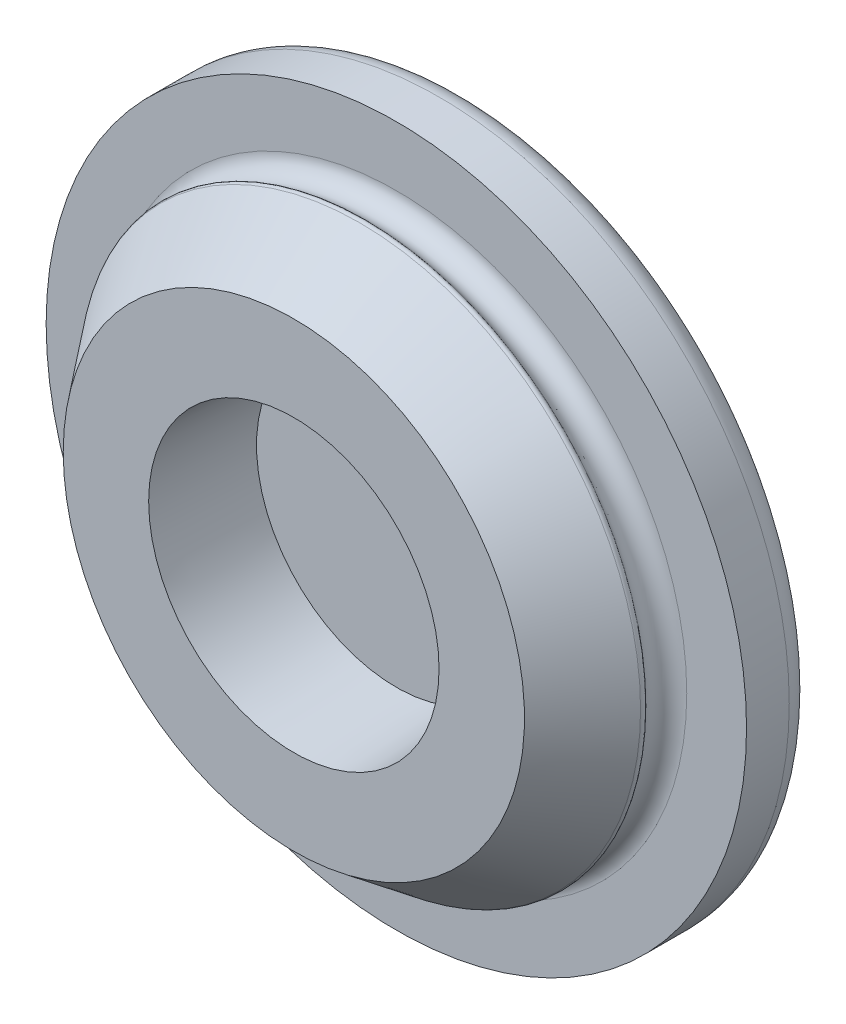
ISO-10303-21;
HEADER;
FILE_DESCRIPTION(('STEP AP214'),'2;1');
FILE_NAME('part.step','',(''),(''),'','','');
FILE_SCHEMA(('AUTOMOTIVE_DESIGN { 1 0 10303 214 1 1 1 1 }'));
ENDSEC;
DATA;
#1=APPLICATION_CONTEXT('core data for automotive mechanical design processes');
#2=APPLICATION_PROTOCOL_DEFINITION('international standard','automotive_design',2000,#1);
#3=PRODUCT_CONTEXT('',#1,'mechanical');
#4=PRODUCT('Part','Part','',(#3));
#5=PRODUCT_RELATED_PRODUCT_CATEGORY('part','',(#4));
#6=PRODUCT_DEFINITION_FORMATION('','',#4);
#7=PRODUCT_DEFINITION_CONTEXT('part definition',#1,'design');
#8=PRODUCT_DEFINITION('design','',#6,#7);
#9=PRODUCT_DEFINITION_SHAPE('','',#8);
#10=(LENGTH_UNIT() NAMED_UNIT(*) SI_UNIT(.MILLI.,.METRE.));
#11=(NAMED_UNIT(*) PLANE_ANGLE_UNIT() SI_UNIT($,.RADIAN.));
#12=(NAMED_UNIT(*) SI_UNIT($,.STERADIAN.) SOLID_ANGLE_UNIT());
#13=UNCERTAINTY_MEASURE_WITH_UNIT(LENGTH_MEASURE(1.E-05),#10,'distance_accuracy_value','');
#14=(GEOMETRIC_REPRESENTATION_CONTEXT(3) GLOBAL_UNCERTAINTY_ASSIGNED_CONTEXT((#13)) GLOBAL_UNIT_ASSIGNED_CONTEXT((#10,
#11,#12)) REPRESENTATION_CONTEXT('',''));
#15=CARTESIAN_POINT('',(0.,0.,0.));
#16=DIRECTION('',(0.,0.,1.));
#17=DIRECTION('',(1.,0.,0.));
#18=AXIS2_PLACEMENT_3D('',#15,#16,#17);
#19=CARTESIAN_POINT('',(4.09277666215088,0.,4.));
#20=DIRECTION('',(0.,0.,1.));
#21=DIRECTION('',(1.,0.,0.));
#22=AXIS2_PLACEMENT_3D('',#19,#20,#21);
#23=PLANE('',#22);
#24=CARTESIAN_POINT('',(0.,0.,3.9999999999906));
#25=DIRECTION('',(0.,0.,1.));
#26=DIRECTION('',(1.,0.,0.));
#27=AXIS2_PLACEMENT_3D('',#24,#25,#26);
#28=CIRCLE('',#27,8.18555332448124);
#29=CARTESIAN_POINT('',(8.18555332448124,0.,3.9999999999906));
#30=VERTEX_POINT('',#29);
#31=EDGE_CURVE('E17',#30,#30,#28,.T.);
#32=ORIENTED_EDGE('',*,*,#31,.T.);
#33=EDGE_LOOP('',(#32));
#34=FACE_BOUND('',#33,.T.);
#35=ADVANCED_FACE('F13',(#34),#23,.T.);
#36=CARTESIAN_POINT('',(0.,0.,10.0000000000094));
#37=DIRECTION('',(0.,0.,1.));
#38=DIRECTION('',(1.,0.,0.));
#39=AXIS2_PLACEMENT_3D('',#36,#37,#38);
#40=CONICAL_SURFACE('',#39,8.49999999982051,0.0523598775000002);
#41=CARTESIAN_POINT('',(0.,0.,10.0000000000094));
#42=DIRECTION('',(0.,0.,1.));
#43=DIRECTION('',(1.,0.,0.));
#44=AXIS2_PLACEMENT_3D('',#41,#42,#43);
#45=CIRCLE('',#44,8.49999999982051);
#46=CARTESIAN_POINT('',(8.49999999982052,0.,10.0000000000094));
#47=VERTEX_POINT('',#46);
#48=EDGE_CURVE('E86',#47,#47,#45,.F.);
#49=ORIENTED_EDGE('',*,*,#48,.F.);
#50=EDGE_LOOP('',(#49));
#51=FACE_BOUND('',#50,.T.);
#52=ORIENTED_EDGE('',*,*,#31,.F.);
#53=EDGE_LOOP('',(#52));
#54=FACE_BOUND('',#53,.T.);
#55=ADVANCED_FACE('F94',(#51,#54),#40,.F.);
#56=CARTESIAN_POINT('',(11.,0.,10.));
#57=DIRECTION('',(0.,0.,1.));
#58=DIRECTION('',(1.,0.,0.));
#59=AXIS2_PLACEMENT_3D('',#56,#57,#58);
#60=PLANE('',#59);
#61=ORIENTED_EDGE('',*,*,#48,.T.);
#62=EDGE_LOOP('',(#61));
#63=FACE_BOUND('',#62,.T.);
#64=CARTESIAN_POINT('',(0.,0.,10.0000000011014));
#65=DIRECTION('',(0.,0.,-1.));
#66=DIRECTION('',(-1.,0.,0.));
#67=AXIS2_PLACEMENT_3D('',#64,#65,#66);
#68=CIRCLE('',#67,13.5000000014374);
#69=CARTESIAN_POINT('',(-13.5000000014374,0.,10.0000000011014));
#70=VERTEX_POINT('',#69);
#71=EDGE_CURVE('E80',#70,#70,#68,.T.);
#72=ORIENTED_EDGE('',*,*,#71,.F.);
#73=EDGE_LOOP('',(#72));
#74=FACE_BOUND('',#73,.T.);
#75=ADVANCED_FACE('F96',(#63,#74),#60,.T.);
#76=CARTESIAN_POINT('',(0.,0.,6.15205431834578));
#77=DIRECTION('',(0.,0.,-1.));
#78=DIRECTION('',(-1.,0.,0.));
#79=AXIS2_PLACEMENT_3D('',#76,#77,#78);
#80=CONICAL_SURFACE('',#79,16.4484426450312,0.653812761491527);
#81=CARTESIAN_POINT('',(0.,0.,6.15205431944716));
#82=DIRECTION('',(0.,0.,1.));
#83=DIRECTION('',(1.,0.,0.));
#84=AXIS2_PLACEMENT_3D('',#81,#82,#83);
#85=CIRCLE('',#84,16.4484426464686);
#86=CARTESIAN_POINT('',(16.4484426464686,0.,6.15205431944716));
#87=VERTEX_POINT('',#86);
#88=EDGE_CURVE('E77',#87,#87,#85,.F.);
#89=ORIENTED_EDGE('',*,*,#88,.F.);
#90=EDGE_LOOP('',(#89));
#91=FACE_BOUND('',#90,.T.);
#92=ORIENTED_EDGE('',*,*,#71,.T.);
#93=EDGE_LOOP('',(#92));
#94=FACE_BOUND('',#93,.T.);
#95=ADVANCED_FACE('F71',(#91,#94),#80,.T.);
#96=CARTESIAN_POINT('',(0.,0.,6.));
#97=DIRECTION('',(0.,0.,1.));
#98=DIRECTION('',(1.,0.,0.));
#99=AXIS2_PLACEMENT_3D('',#96,#97,#98);
#100=TOROIDAL_SURFACE('',#99,16.25,0.25);
#101=CARTESIAN_POINT('',(0.,0.,5.80000000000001));
#102=DIRECTION('',(0.,0.,-1.));
#103=DIRECTION('',(-1.,0.,0.));
#104=AXIS2_PLACEMENT_3D('',#101,#102,#103);
#105=CIRCLE('',#104,16.4);
#106=CARTESIAN_POINT('',(-16.4,0.,5.80000000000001));
#107=VERTEX_POINT('',#106);
#108=EDGE_CURVE('E45',#107,#107,#105,.T.);
#109=ORIENTED_EDGE('',*,*,#108,.F.);
#110=EDGE_LOOP('',(#109));
#111=FACE_BOUND('',#110,.T.);
#112=ORIENTED_EDGE('',*,*,#88,.T.);
#113=EDGE_LOOP('',(#112));
#114=FACE_BOUND('',#113,.T.);
#115=ADVANCED_FACE('F67',(#111,#114),#100,.T.);
#116=CARTESIAN_POINT('',(0.,0.,5.));
#117=DIRECTION('',(0.,0.,1.));
#118=DIRECTION('',(1.,0.,0.));
#119=AXIS2_PLACEMENT_3D('',#116,#117,#118);
#120=TOROIDAL_SURFACE('',#119,17.,1.00000000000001);
#121=CARTESIAN_POINT('',(0.,0.,4.));
#122=DIRECTION('',(0.,0.,1.));
#123=DIRECTION('',(1.,0.,0.));
#124=AXIS2_PLACEMENT_3D('',#121,#122,#123);
#125=CIRCLE('',#124,17.);
#126=CARTESIAN_POINT('',(17.,0.,3.99999999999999));
#127=VERTEX_POINT('',#126);
#128=EDGE_CURVE('E31',#127,#127,#125,.F.);
#129=ORIENTED_EDGE('',*,*,#128,.F.);
#130=EDGE_LOOP('',(#129));
#131=FACE_BOUND('',#130,.T.);
#132=ORIENTED_EDGE('',*,*,#108,.T.);
#133=EDGE_LOOP('',(#132));
#134=FACE_BOUND('',#133,.T.);
#135=ADVANCED_FACE('F15',(#131,#134),#120,.F.);
#136=CARTESIAN_POINT('',(18.75,0.,4.));
#137=DIRECTION('',(0.,0.,1.));
#138=DIRECTION('',(1.,0.,0.));
#139=AXIS2_PLACEMENT_3D('',#136,#137,#138);
#140=PLANE('',#139);
#141=ORIENTED_EDGE('',*,*,#128,.T.);
#142=EDGE_LOOP('',(#141));
#143=FACE_BOUND('',#142,.T.);
#144=CARTESIAN_POINT('',(0.,0.,4.));
#145=DIRECTION('',(0.,0.,1.));
#146=DIRECTION('',(1.,0.,0.));
#147=AXIS2_PLACEMENT_3D('',#144,#145,#146);
#148=CIRCLE('',#147,20.5);
#149=CARTESIAN_POINT('',(20.5,0.,4.));
#150=VERTEX_POINT('',#149);
#151=EDGE_CURVE('E26',#150,#150,#148,.F.);
#152=ORIENTED_EDGE('',*,*,#151,.F.);
#153=EDGE_LOOP('',(#152));
#154=FACE_BOUND('',#153,.T.);
#155=ADVANCED_FACE('F62',(#143,#154),#140,.T.);
#156=CARTESIAN_POINT('',(0.,0.,2.75));
#157=DIRECTION('',(0.,0.,1.));
#158=DIRECTION('',(1.,0.,0.));
#159=AXIS2_PLACEMENT_3D('',#156,#157,#158);
#160=CYLINDRICAL_SURFACE('',#159,20.5);
#161=CARTESIAN_POINT('',(0.,0.,1.50000000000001));
#162=DIRECTION('',(0.,0.,1.));
#163=DIRECTION('',(1.,0.,0.));
#164=AXIS2_PLACEMENT_3D('',#161,#162,#163);
#165=CIRCLE('',#164,20.5);
#166=CARTESIAN_POINT('',(20.5,0.,1.5));
#167=VERTEX_POINT('',#166);
#168=EDGE_CURVE('E21',#167,#167,#165,.F.);
#169=ORIENTED_EDGE('',*,*,#168,.F.);
#170=EDGE_LOOP('',(#169));
#171=FACE_BOUND('',#170,.T.);
#172=ORIENTED_EDGE('',*,*,#151,.T.);
#173=EDGE_LOOP('',(#172));
#174=FACE_BOUND('',#173,.T.);
#175=ADVANCED_FACE('F58',(#171,#174),#160,.T.);
#176=CARTESIAN_POINT('',(0.,0.,1.50000000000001));
#177=DIRECTION('',(0.,0.,1.));
#178=DIRECTION('',(1.,0.,0.));
#179=AXIS2_PLACEMENT_3D('',#176,#177,#178);
#180=TOROIDAL_SURFACE('',#179,19.,1.5);
#181=CARTESIAN_POINT('',(0.,0.,0.));
#182=DIRECTION('',(0.,0.,1.));
#183=DIRECTION('',(1.,0.,0.));
#184=AXIS2_PLACEMENT_3D('',#181,#182,#183);
#185=CIRCLE('',#184,19.);
#186=CARTESIAN_POINT('',(19.,0.,0.));
#187=VERTEX_POINT('',#186);
#188=EDGE_CURVE('E9',#187,#187,#185,.F.);
#189=ORIENTED_EDGE('',*,*,#188,.F.);
#190=EDGE_LOOP('',(#189));
#191=FACE_BOUND('',#190,.T.);
#192=ORIENTED_EDGE('',*,*,#168,.T.);
#193=EDGE_LOOP('',(#192));
#194=FACE_BOUND('',#193,.T.);
#195=ADVANCED_FACE('F47',(#191,#194),#180,.T.);
#196=CARTESIAN_POINT('',(9.5,0.,0.));
#197=DIRECTION('',(0.,0.,-1.));
#198=DIRECTION('',(-1.,0.,0.));
#199=AXIS2_PLACEMENT_3D('',#196,#197,#198);
#200=PLANE('',#199);
#201=ORIENTED_EDGE('',*,*,#188,.T.);
#202=EDGE_LOOP('',(#201));
#203=FACE_BOUND('',#202,.T.);
#204=ADVANCED_FACE('F57',(#203),#200,.T.);
#205=CLOSED_SHELL('',(#35,#55,#75,#95,#115,#135,#155,#175,#195,#204));
#206=MANIFOLD_SOLID_BREP('B1',#205);
#207=ADVANCED_BREP_SHAPE_REPRESENTATION('',(#18,#206),#14);
#208=SHAPE_DEFINITION_REPRESENTATION(#9,#207);
ENDSEC;
END-ISO-10303-21;
